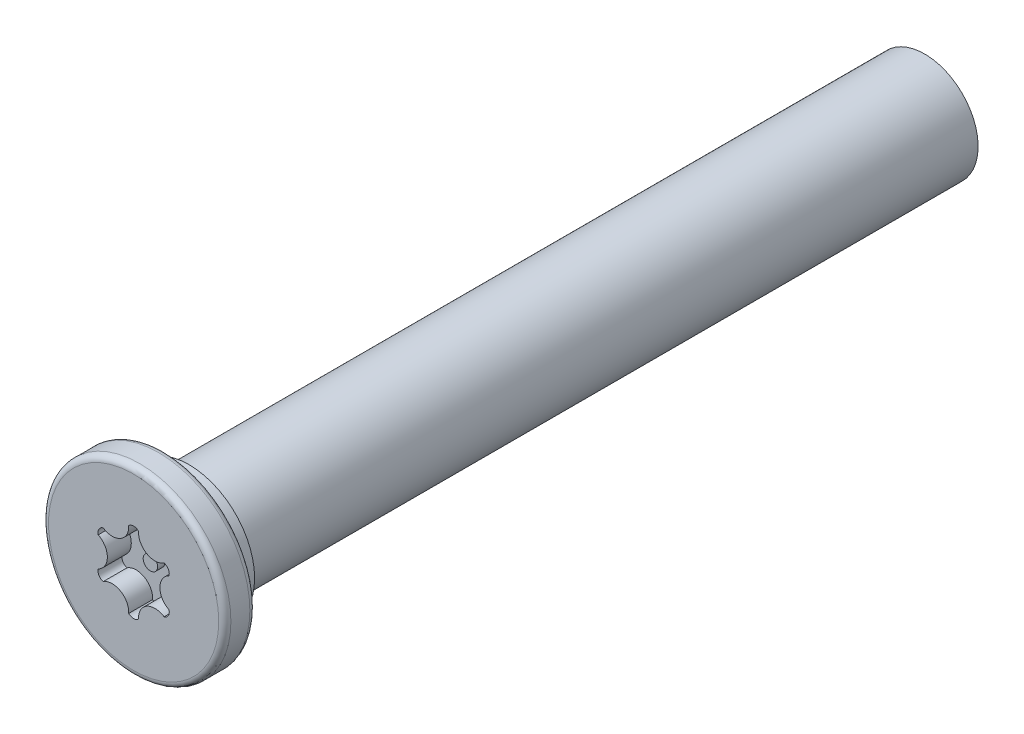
from build123d import *

# Parameters (mm, degrees)
SKETCH2_W           = 1.3
SKETCH2_H           = 3.81
SKETCH2_W_2         = 12.7
SKETCH2_H_2         = 2.23
CUT_EXTRUDE3_DEPTH  = 1
FILLET12_R          = 0.254
CUT_EXTRUDE6_START  = -12.7
SKETCH7_R           = 2.23
CUT_EXTRUDE6_DEPTH  = 12.7
SKETCH11_R          = 2.738000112
SKETCH11_R_2        = 2.230000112
BOSS_EXTRUDE1_DEPTH = 1.016
SKETCH12_R          = 2.230000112
BOSS_EXTRUDE2_DEPTH = 12.7
SKETCH14_R          = 0.3
BOSS_EXTRUDE4_DEPTH = 0.3
CUT_EXTRUDE7_START  = -12.7
SKETCH15_R          = 2.230000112
CUT_EXTRUDE7_DEPTH  = 12.7
SKETCH16_R          = 2.230000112
BOSS_EXTRUDE5_DEPTH = 31.75


with BuildPart() as part:
    # Sketch2 → Revolve1 (revolve)
    with BuildSketch(Plane(origin=(0, 0, 0), x_dir=(0, 0, -1), z_dir=(1, 0, 0)), mode=Mode.PRIVATE) as revolve1_sk:
        with Locations((0.65, 1.905)):
            Rectangle(SKETCH2_W, SKETCH2_H)
        with Locations((7.65, 1.115)):
            Rectangle(SKETCH2_W_2, SKETCH2_H_2)
    revolve(revolve1_sk.sketch.rotate(Axis((0, 0, -1.3), (0, 0, -1)), 90), axis=Axis((0, 0, -1.3), (0, 0, -1)))

    # Sketch3 → Cut-Extrude3 (cut)
    with BuildSketch(Plane.XY):
        with BuildLine():
            ThreePointArc((-0.205060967, 1.589373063), (0, 1.674312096), (0.205060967, 1.589373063))
            ThreePointArc((0.205060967, 1.589373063), (0.54882888, 0.950599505), (1.273906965, 0.972274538))
            ThreePointArc((1.273906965, 0.972274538), (1.449996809, 0.837156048), (1.478967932, 0.617098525))
            ThreePointArc((1.478967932, 0.617098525), (1.097657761, 0), (1.478967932, -0.617098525))
            ThreePointArc((1.478967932, -0.617098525), (1.449996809, -0.837156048), (1.273906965, -0.972274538))
            ThreePointArc((1.273906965, -0.972274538), (0.54882888, -0.950599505), (0.205060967, -1.589373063))
            ThreePointArc((0.205060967, -1.589373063), (0, -1.674312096), (-0.205060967, -1.589373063))
            ThreePointArc((-0.205060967, -1.589373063), (-0.54882888, -0.950599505), (-1.273906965, -0.972274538))
            ThreePointArc((-1.273906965, -0.972274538), (-1.449996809, -0.837156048), (-1.478967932, -0.617098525))
            ThreePointArc((-1.478967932, -0.617098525), (-1.097657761, 0), (-1.478967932, 0.617098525))
            ThreePointArc((-1.478967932, 0.617098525), (-1.449996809, 0.837156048), (-1.273906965, 0.972274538))
            ThreePointArc((-1.273906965, 0.972274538), (-0.54882888, 0.950599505), (-0.205060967, 1.589373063))
        make_face()
    extrude(amount=-CUT_EXTRUDE3_DEPTH, mode=Mode.SUBTRACT)

    # Fillet12
    fillet12_edges = [part.edges().sort_by_distance(p)[0] for p in [
        (-3.81, 0, 0),
        (-3.81, 0, -1.3),
    ]]
    fillet(fillet12_edges, radius=FILLET12_R)

    # Sketch7 → Cut-Extrude6 (cut)
    with BuildSketch(Plane(origin=(0, 0, -14), x_dir=(-1, 0, 0), z_dir=(0, 0, -1)).offset(CUT_EXTRUDE6_START)):
        Circle(SKETCH7_R)
    extrude(amount=CUT_EXTRUDE6_DEPTH, mode=Mode.SUBTRACT)

    # Sketch11 → Boss-Extrude1 (add)
    with BuildSketch(Plane(origin=(0, 0, -1.3), x_dir=(-1, 0, 0), z_dir=(0, 0, -1))):
        with Locations(Location((0, 0, 0), (0, 0, 180))):
            Circle(SKETCH11_R)
        Circle(SKETCH11_R_2, mode=Mode.SUBTRACT)
    extrude(amount=BOSS_EXTRUDE1_DEPTH)

    # Sketch12 → Boss-Extrude2 (add)
    with BuildSketch(Plane(origin=(0, 0, -1.3), x_dir=(-1, 0, 0), z_dir=(0, 0, -1))):
        Circle(SKETCH12_R)
    extrude(amount=BOSS_EXTRUDE2_DEPTH)

    # Sketch14 → Boss-Extrude4 (add)
    with BuildSketch(Plane.XY.offset(-1)):
        Circle(SKETCH14_R)
    extrude(amount=BOSS_EXTRUDE4_DEPTH)

    # Sketch15 → Cut-Extrude7 (cut)
    with BuildSketch(Plane(origin=(0, 0, -14), x_dir=(-1, 0, 0), z_dir=(0, 0, -1)).offset(CUT_EXTRUDE7_START)):
        Circle(SKETCH15_R)
    extrude(amount=CUT_EXTRUDE7_DEPTH, mode=Mode.SUBTRACT)

    # Sketch16 → Boss-Extrude5 (add)
    with BuildSketch(Plane(origin=(0, 0, -1.3), x_dir=(-1, 0, 0), z_dir=(0, 0, -1))):
        Circle(SKETCH16_R)
    extrude(amount=BOSS_EXTRUDE5_DEPTH)


solid = part.part
